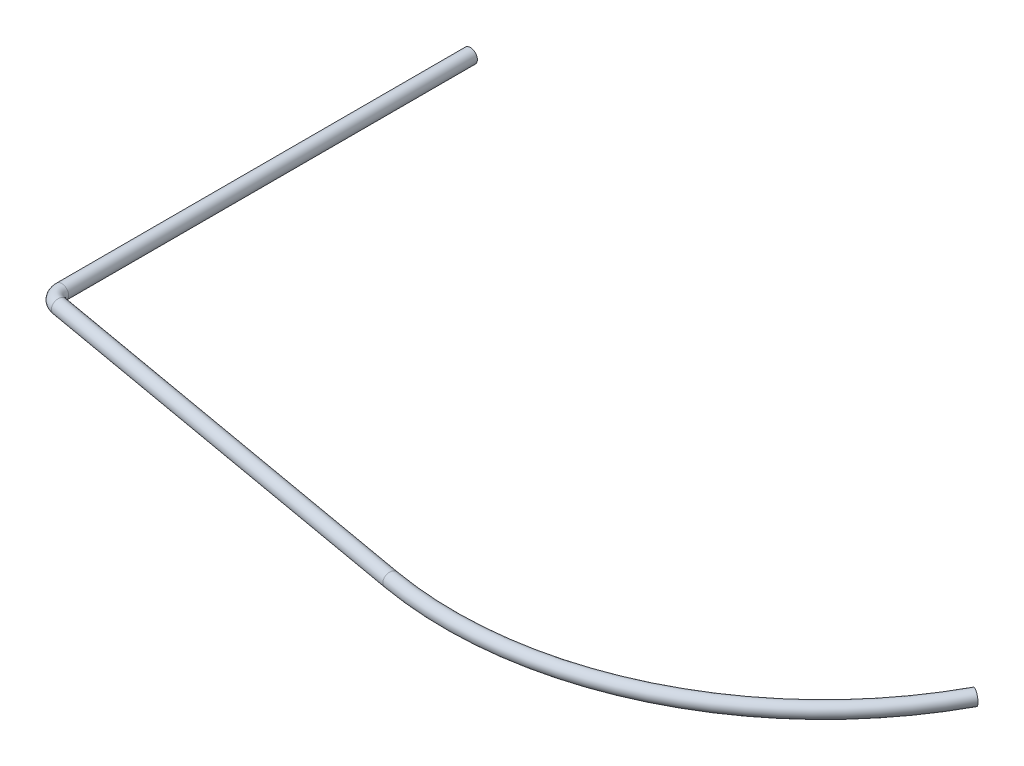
ISO-10303-21;
HEADER;
FILE_DESCRIPTION(('STEP AP214'),'2;1');
FILE_NAME('part.step','',(''),(''),'','','');
FILE_SCHEMA(('AUTOMOTIVE_DESIGN { 1 0 10303 214 1 1 1 1 }'));
ENDSEC;
DATA;
#1=APPLICATION_CONTEXT('core data for automotive mechanical design processes');
#2=APPLICATION_PROTOCOL_DEFINITION('international standard','automotive_design',2000,#1);
#3=PRODUCT_CONTEXT('',#1,'mechanical');
#4=PRODUCT('Part','Part','',(#3));
#5=PRODUCT_RELATED_PRODUCT_CATEGORY('part','',(#4));
#6=PRODUCT_DEFINITION_FORMATION('','',#4);
#7=PRODUCT_DEFINITION_CONTEXT('part definition',#1,'design');
#8=PRODUCT_DEFINITION('design','',#6,#7);
#9=PRODUCT_DEFINITION_SHAPE('','',#8);
#10=(LENGTH_UNIT() NAMED_UNIT(*) SI_UNIT(.MILLI.,.METRE.));
#11=(NAMED_UNIT(*) PLANE_ANGLE_UNIT() SI_UNIT($,.RADIAN.));
#12=(NAMED_UNIT(*) SI_UNIT($,.STERADIAN.) SOLID_ANGLE_UNIT());
#13=UNCERTAINTY_MEASURE_WITH_UNIT(LENGTH_MEASURE(1.E-05),#10,'distance_accuracy_value','');
#14=(GEOMETRIC_REPRESENTATION_CONTEXT(3) GLOBAL_UNCERTAINTY_ASSIGNED_CONTEXT((#13)) GLOBAL_UNIT_ASSIGNED_CONTEXT((#10,
#11,#12)) REPRESENTATION_CONTEXT('',''));
#15=CARTESIAN_POINT('',(0.,0.,0.));
#16=DIRECTION('',(0.,0.,1.));
#17=DIRECTION('',(1.,0.,0.));
#18=AXIS2_PLACEMENT_3D('',#15,#16,#17);
#19=CARTESIAN_POINT('',(102.524551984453,0.,26.8437157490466));
#20=DIRECTION('',(0.,1.,0.));
#21=DIRECTION('',(0.,0.,1.));
#22=AXIS2_PLACEMENT_3D('',#19,#20,#21);
#23=TOROIDAL_SURFACE('',#22,80.,1.5);
#24=CARTESIAN_POINT('',(88.6326977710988,0.,105.628335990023));
#25=DIRECTION('',(0.98480775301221,0.,0.173648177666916));
#26=DIRECTION('',(0.173648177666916,0.,-0.98480775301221));
#27=AXIS2_PLACEMENT_3D('',#24,#25,#26);
#28=CIRCLE('',#27,1.5);
#29=CARTESIAN_POINT('',(88.3722255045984,0.,107.105547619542));
#30=VERTEX_POINT('',#29);
#31=EDGE_CURVE('E48',#30,#30,#28,.T.);
#32=CARTESIAN_POINT('',(172.916351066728,0.,64.856800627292));
#33=DIRECTION('',(0.475163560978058,0.,-0.879897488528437));
#34=DIRECTION('',(-0.879897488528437,0.,-0.475163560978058));
#35=AXIS2_PLACEMENT_3D('',#32,#33,#34);
#36=CIRCLE('',#35,1.5);
#37=CARTESIAN_POINT('',(174.23619729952,0.,65.5695459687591));
#38=VERTEX_POINT('',#37);
#39=EDGE_CURVE('E12',#38,#38,#36,.T.);
#40=CARTESIAN_POINT('',(102.524551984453,0.,26.8437157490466));
#41=DIRECTION('',(0.,1.,0.));
#42=DIRECTION('',(0.,0.,1.));
#43=AXIS2_PLACEMENT_3D('',#40,#41,#42);
#44=CIRCLE('',#43,81.5);
#45=EDGE_CURVE('',#30,#38,#44,.T.);
#46=ORIENTED_EDGE('',*,*,#31,.T.);
#47=ORIENTED_EDGE('',*,*,#39,.F.);
#48=ORIENTED_EDGE('',*,*,#45,.T.);
#49=ORIENTED_EDGE('',*,*,#45,.F.);
#50=EDGE_LOOP('',(#46,#48,#47,#49));
#51=FACE_BOUND('',#50,.T.);
#52=ADVANCED_FACE('F42',(#51),#23,.T.);
#53=CARTESIAN_POINT('',(2.47905546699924,0.,90.4371243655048));
#54=DIRECTION('',(0.984807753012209,0.,0.173648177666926));
#55=DIRECTION('',(0.173648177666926,0.,-0.984807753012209));
#56=AXIS2_PLACEMENT_3D('',#53,#54,#55);
#57=CYLINDRICAL_SURFACE('',#56,1.5);
#58=CARTESIAN_POINT('',(2.47905546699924,0.,90.4371243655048));
#59=DIRECTION('',(0.98480775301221,0.,0.173648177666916));
#60=DIRECTION('',(0.173648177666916,0.,-0.98480775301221));
#61=AXIS2_PLACEMENT_3D('',#58,#59,#60);
#62=CIRCLE('',#61,1.5);
#63=CARTESIAN_POINT('',(2.21858320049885,0.,91.9143359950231));
#64=VERTEX_POINT('',#63);
#65=EDGE_CURVE('E52',#64,#64,#62,.T.);
#66=ORIENTED_EDGE('',*,*,#65,.T.);
#67=EDGE_LOOP('',(#66));
#68=FACE_BOUND('',#67,.T.);
#69=ORIENTED_EDGE('',*,*,#31,.F.);
#70=EDGE_LOOP('',(#69));
#71=FACE_BOUND('',#70,.T.);
#72=ADVANCED_FACE('F83',(#68,#71),#57,.T.);
#73=CARTESIAN_POINT('',(3.00000000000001,0.,87.4827011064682));
#74=DIRECTION('',(0.,1.,0.));
#75=DIRECTION('',(0.,0.,1.));
#76=AXIS2_PLACEMENT_3D('',#73,#74,#75);
#77=TOROIDAL_SURFACE('',#76,3.,1.5);
#78=CARTESIAN_POINT('',(0.,0.,87.4827011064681));
#79=DIRECTION('',(0.,0.,1.));
#80=DIRECTION('',(1.,0.,0.));
#81=AXIS2_PLACEMENT_3D('',#78,#79,#80);
#82=CIRCLE('',#81,1.5);
#83=CARTESIAN_POINT('',(-1.49999999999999,0.,87.4827011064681));
#84=VERTEX_POINT('',#83);
#85=EDGE_CURVE('E56',#84,#84,#82,.T.);
#86=CARTESIAN_POINT('',(3.00000000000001,0.,87.4827011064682));
#87=DIRECTION('',(0.,1.,0.));
#88=DIRECTION('',(0.,0.,1.));
#89=AXIS2_PLACEMENT_3D('',#86,#87,#88);
#90=CIRCLE('',#89,4.5);
#91=EDGE_CURVE('',#84,#64,#90,.T.);
#92=ORIENTED_EDGE('',*,*,#85,.T.);
#93=ORIENTED_EDGE('',*,*,#65,.F.);
#94=ORIENTED_EDGE('',*,*,#91,.T.);
#95=ORIENTED_EDGE('',*,*,#91,.F.);
#96=EDGE_LOOP('',(#92,#94,#93,#95));
#97=FACE_BOUND('',#96,.T.);
#98=ADVANCED_FACE('F65',(#97),#77,.T.);
#99=CARTESIAN_POINT('',(0.,0.,87.4827011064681));
#100=DIRECTION('',(0.,0.,-1.));
#101=DIRECTION('',(-1.,0.,0.));
#102=AXIS2_PLACEMENT_3D('',#99,#100,#101);
#103=CYLINDRICAL_SURFACE('',#102,1.5);
#104=ORIENTED_EDGE('',*,*,#85,.F.);
#105=EDGE_LOOP('',(#104));
#106=FACE_BOUND('',#105,.T.);
#107=CARTESIAN_POINT('',(0.,0.,0.));
#108=DIRECTION('',(0.,0.,1.));
#109=DIRECTION('',(1.,0.,0.));
#110=AXIS2_PLACEMENT_3D('',#107,#108,#109);
#111=CIRCLE('',#110,1.5);
#112=CARTESIAN_POINT('',(1.5,0.,0.));
#113=VERTEX_POINT('',#112);
#114=EDGE_CURVE('E59',#113,#113,#111,.T.);
#115=ORIENTED_EDGE('',*,*,#114,.T.);
#116=EDGE_LOOP('',(#115));
#117=FACE_BOUND('',#116,.T.);
#118=ADVANCED_FACE('F68',(#106,#117),#103,.T.);
#119=CARTESIAN_POINT('',(172.916351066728,0.,64.856800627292));
#120=DIRECTION('',(0.475163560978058,0.,-0.879897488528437));
#121=DIRECTION('',(-0.879897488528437,0.,-0.475163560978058));
#122=AXIS2_PLACEMENT_3D('',#119,#120,#121);
#123=PLANE('',#122);
#124=ORIENTED_EDGE('',*,*,#39,.T.);
#125=EDGE_LOOP('',(#124));
#126=FACE_BOUND('',#125,.T.);
#127=ADVANCED_FACE('F71',(#126),#123,.T.);
#128=CARTESIAN_POINT('',(0.,0.,0.));
#129=DIRECTION('',(0.,0.,1.));
#130=DIRECTION('',(1.,0.,0.));
#131=AXIS2_PLACEMENT_3D('',#128,#129,#130);
#132=PLANE('',#131);
#133=ORIENTED_EDGE('',*,*,#114,.F.);
#134=EDGE_LOOP('',(#133));
#135=FACE_BOUND('',#134,.T.);
#136=ADVANCED_FACE('F75',(#135),#132,.F.);
#137=CLOSED_SHELL('',(#52,#72,#98,#118,#127,#136));
#138=MANIFOLD_SOLID_BREP('B2',#137);
#139=ADVANCED_BREP_SHAPE_REPRESENTATION('',(#18,#138),#14);
#140=SHAPE_DEFINITION_REPRESENTATION(#9,#139);
ENDSEC;
END-ISO-10303-21;
